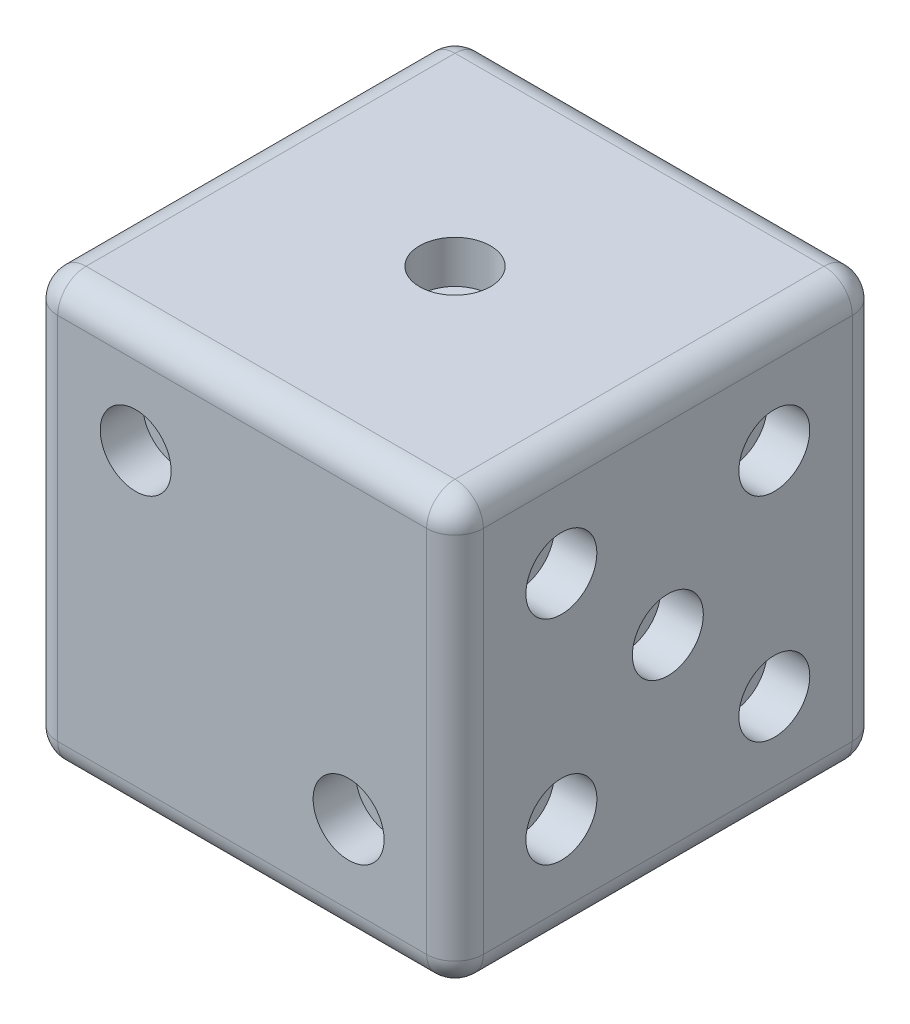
from build123d import *

# Parameters (mm, degrees)
ESQUISSE1_W             = 30
ESQUISSE1_H             = 30
BOSS_EXTRU_6_DEPTH      = 30
ESQUISSE1_6_R           = 2.5
ENL_V_MAT_EXTRU_1_DEPTH = 3
ESQUISSE6_R             = 2.5
ENL_V_MAT_EXTRU_2_DEPTH = 3
ESQUISSE7_R             = 2.5
ENL_V_MAT_EXTRU_3_DEPTH = 3
ENL_V_START             = -3
ESQUISSE5_R             = 2.5
ENL_V_MAT_EXTRU_4_DEPTH = 3
ESQUISSE8_R             = 2.5
ENL_V_MAT_EXTRU_5_DEPTH = 3
ESQUISSE4_R             = 2.5
ENL_V_MAT_EXTRU_6_DEPTH = 3
CONG_2_R                = 2
CONG_3_R                = 2


with BuildPart() as part:
    # Esquisse1 → Boss.-Extru.6 (new body)
    with BuildSketch(Plane(origin=(0, 0, 0), x_dir=(1, 0, 0), z_dir=(0, 1, 0))):
        with Locations((15, 15)):
            Rectangle(ESQUISSE1_W, ESQUISSE1_H)
    extrude(amount=BOSS_EXTRU_6_DEPTH)

    # Esquisse1_6 → Enl_v. mat.-Extru.1 (cut)
    with BuildSketch(Plane(origin=(0, 0, 0), x_dir=(1, 0, 0), z_dir=(0, 1, 0))):
        with Locations(Location((7.5, 15, 0), (0, 0, 270))):
            Circle(ESQUISSE1_6_R)
        with Locations(Location((7.5, 22.5, 0), (0, 0, 270))):
            Circle(ESQUISSE1_6_R)
        with Locations(Location((7.5, 7.5, 0), (0, 0, 90))):
            Circle(ESQUISSE1_6_R)
        with Locations(Location((22.5, 7.5, 0), (0, 0, 270))):
            Circle(ESQUISSE1_6_R)
        with Locations(Location((22.5, 15, 0), (0, 0, 90))):
            Circle(ESQUISSE1_6_R)
        with Locations(Location((22.5, 22.5, 0), (0, 0, 90))):
            Circle(ESQUISSE1_6_R)
    extrude(amount=ENL_V_MAT_EXTRU_1_DEPTH, mode=Mode.SUBTRACT)

    # Esquisse6 → Enl_v. mat.-Extru.2 (cut)
    with BuildSketch(Plane(origin=(0, 0, -30), x_dir=(-1, 0, 0), z_dir=(0, 0, -1))):
        with Locations((-15, 15)):
            Circle(ESQUISSE6_R)
        with Locations((-22.502402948, 7.497597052)):
            Circle(ESQUISSE6_R)
        with Locations((-7.497597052, 22.502402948)):
            Circle(ESQUISSE6_R)
    extrude(amount=-ENL_V_MAT_EXTRU_2_DEPTH, mode=Mode.SUBTRACT)

    # Esquisse7 → Enl_v. mat.-Extru.3 (cut)
    with BuildSketch(Plane.ZY):
        with Locations((-22.502402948, 22.502402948)):
            Circle(ESQUISSE7_R)
        with Locations(Location((-7.497597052, 22.502402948, 0), (0, 0, 180))):
            Circle(ESQUISSE7_R)
        with Locations((-7.497597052, 7.497597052)):
            Circle(ESQUISSE7_R)
        with Locations(Location((-22.502402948, 7.497597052, 0), (0, 0, 180))):
            Circle(ESQUISSE7_R)
    extrude(amount=-ENL_V_MAT_EXTRU_3_DEPTH, mode=Mode.SUBTRACT)

    # Esquisse5 → Enl_v. mat.-Extru.4 (cut)
    with BuildSketch(Plane.XY.offset(ENL_V_START)):
        with Locations(Location((7.497597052, 22.502402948, 0), (0, 0, 180))):
            Circle(ESQUISSE5_R)
        with Locations(Location((22.502402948, 7.497597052, 0), (0, 0, 180))):
            Circle(ESQUISSE5_R)
    extrude(amount=ENL_V_MAT_EXTRU_4_DEPTH, mode=Mode.SUBTRACT)

    # Esquisse8 → Enl_v. mat.-Extru.5 (cut)
    with BuildSketch(Plane(origin=(30, 0, 0), x_dir=(0, 0, -1), z_dir=(1, 0, 0)).offset(ENL_V_START)):
        with Locations((15, 15)):
            Circle(ESQUISSE8_R)
        with Locations((7.497597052, 22.502402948)):
            Circle(ESQUISSE8_R)
        with Locations(Location((22.502402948, 22.502402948, 0), (0, 0, 180))):
            Circle(ESQUISSE8_R)
        with Locations((22.502402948, 7.497597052)):
            Circle(ESQUISSE8_R)
        with Locations(Location((7.497597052, 7.497597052, 0), (0, 0, 180))):
            Circle(ESQUISSE8_R)
    extrude(amount=ENL_V_MAT_EXTRU_5_DEPTH, mode=Mode.SUBTRACT)

    # Esquisse4 → Enl_v. mat.-Extru.6 (cut)
    with BuildSketch(Plane(origin=(0, 30, 0), x_dir=(1, 0, 0), z_dir=(0, 1, 0))):
        with Locations(Location((15, 15, 0), (0, 0, 270))):
            Circle(ESQUISSE4_R)
    extrude(amount=-ENL_V_MAT_EXTRU_6_DEPTH, mode=Mode.SUBTRACT)

    # Cong_2
    cong_2_edges = [part.edges().sort_by_distance(p)[0] for p in [
        (30, 30, -15),
        (15, 30, 0),
        (0, 30, -15),
        (15, 30, -30),
        (0, 15, 0),
        (30, 15, 0),
        (30, 15, -30),
        (0, 15, -30),
    ]]
    fillet(cong_2_edges, radius=CONG_2_R)

    # Cong_3
    cong_3_edges = [part.edges().sort_by_distance(p)[0] for p in [
        (0, 0, -15),
        (15, 0, -30),
        (30, 0, -15),
        (15, 0, 0),
        (29.414213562, 0, -29.414213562),
        (29.414213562, 0, -0.585786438),
        (0.585786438, 0, -0.585786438),
        (0.585786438, 0, -29.414213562),
    ]]
    fillet(cong_3_edges, radius=CONG_3_R)


solid = part.part
